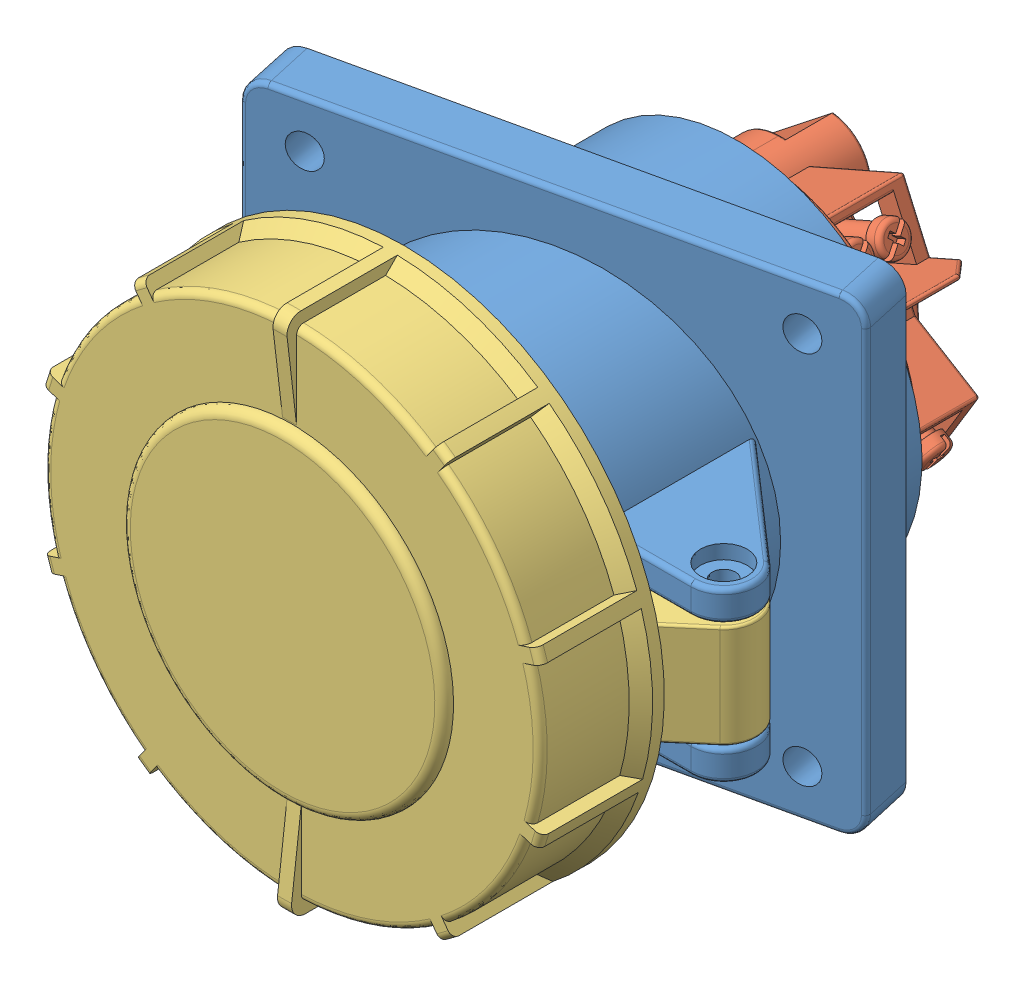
SolidWorks assembly Розетка стационарная внутренняя угловая ps-4342-63-380.SLDASM, configuration По умолчанию (file format 10000). Lengths in mm.
Overall size (119.46 111.32 132.28).
3 component instances, 3 part files, 5 mates.
Components (placement in the parent):
- Корпус 4352,4342-1: Корпус 4352,4342.SLDPRT [По умолчанию] at (99.3229 85.6789 -21.549) size (119.46 100 82)
- Колодка 3342,4342-1: Колодка 3342,4342.SLDPRT [По умолчанию] at (99.3229 85.6789 -21.549) x (0.519587 0.854417 0) z (0 0 -1) size (72 72 112.04)
- Крышка 3342, 4342, 3352, 4352-1: Крышка 3342, 4342, 3352, 4352.SLDPRT [По умолчанию] at (99.3229 85.6789 73.451) x (0 1 0) z (0 0 -1) size (111.32 117.7 46.24)
Mates (geometry in assembly coordinates):
- Концентричный1: concentric anti-aligned: cylinder of Корпус 4352,4342-1 through (99.3229 85.6789 -46.549) axis (0 0 1) radius 36.5; cylinder of Колодка 3342,4342-1 through (99.3229 85.6789 55.451) axis (0 0 -1) radius 30
- Совпадение1: coincident anti-aligned: plane of Корпус 4352,4342-1 through (99.3229 85.6789 -21.549) normal (0 0 -1); plane of Колодка 3342,4342-1 through (99.3229 85.6789 -21.549) normal (0 0 1)
- Концентричный2: concentric anti-aligned: cylinder of Корпус 4352,4342-1 through (99.3229 85.6789 -46.549) axis (0 0 1) radius 36.5; cylinder of Крышка 3342, 4342, 3352, 4352-1 through (99.3229 85.6789 60.451) axis (0 0 -1) radius 50.5
- Параллельность1: parallel anti-aligned: plane of Корпус 4352,4342-1 through (168.7653 97.1789 -0.549) normal (0 -1 0); plane of Крышка 3342, 4342, 3352, 4352-1 through (154.5227 96.6789 36.451) normal (0 1 0)
- Совпадение2: coincident anti-aligned: plane of Корпус 4352,4342-1 through (99.3229 85.6789 60.451) normal (0 0 1); plane of Крышка 3342, 4342, 3352, 4352-1 through (99.3229 85.6789 60.451) normal (0 0 -1)
